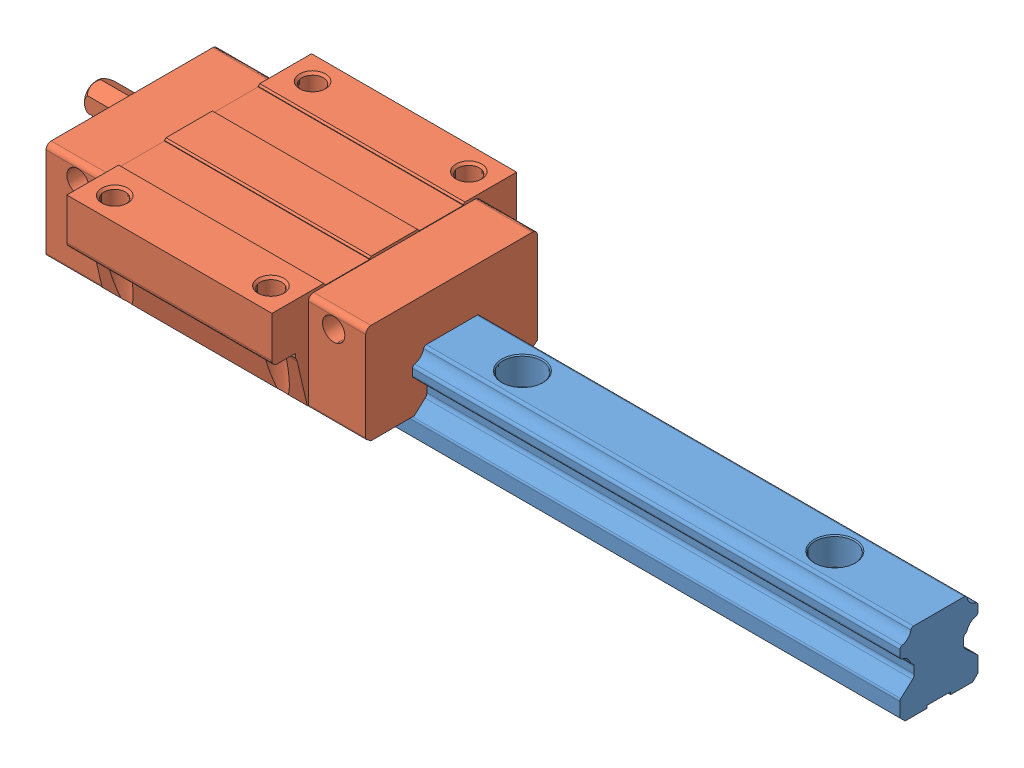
SolidWorks assembly HLW15CC.stp.sldasm, configuration 默认 (file format 13000). Lengths in mm.
Overall size (162.3 24 47).
2 component instances, 2 part files, 0 mates.
Components (placement in the parent):
- HLR15R160 E=20-1: HLR15R160 E=20.SLDPRT [默认] at origin size (160 15 15)
- HLW15CC-1: HLW15CC.SLDPRT [默认] at (5 4.3 0) size (68.7 19.7 47)
